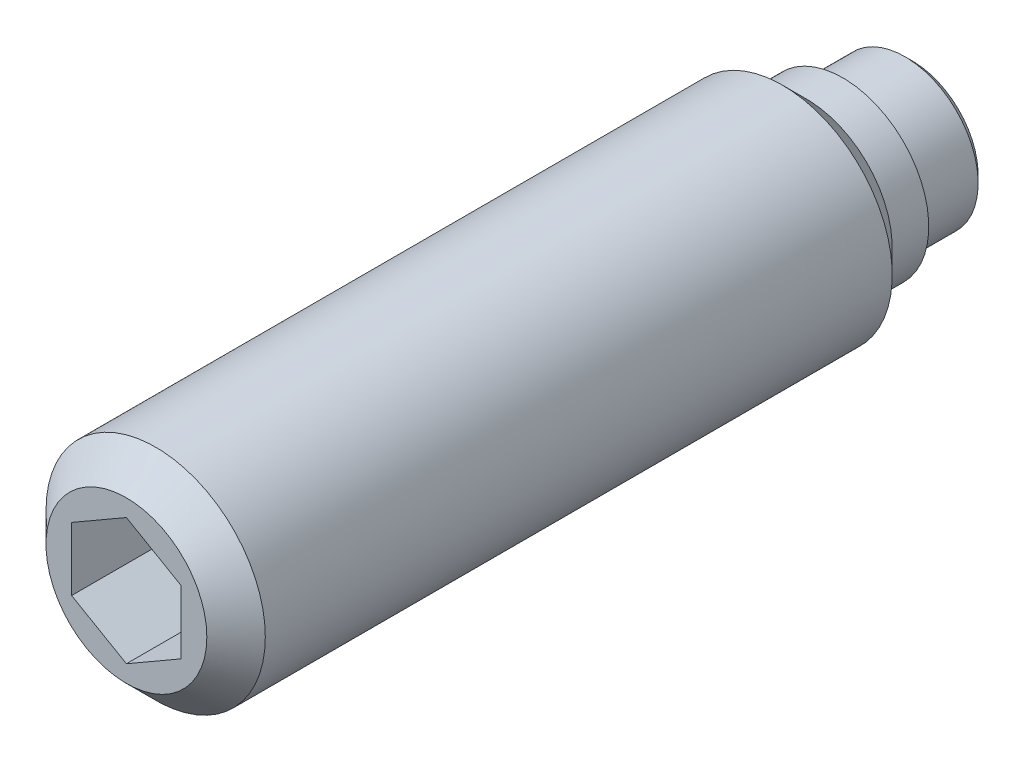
ISO-10303-21;
HEADER;
FILE_DESCRIPTION(('STEP AP214'),'2;1');
FILE_NAME('part.step','',(''),(''),'','','');
FILE_SCHEMA(('AUTOMOTIVE_DESIGN { 1 0 10303 214 1 1 1 1 }'));
ENDSEC;
DATA;
#1=APPLICATION_CONTEXT('core data for automotive mechanical design processes');
#2=APPLICATION_PROTOCOL_DEFINITION('international standard','automotive_design',2000,#1);
#3=PRODUCT_CONTEXT('',#1,'mechanical');
#4=PRODUCT('Part','Part','',(#3));
#5=PRODUCT_RELATED_PRODUCT_CATEGORY('part','',(#4));
#6=PRODUCT_DEFINITION_FORMATION('','',#4);
#7=PRODUCT_DEFINITION_CONTEXT('part definition',#1,'design');
#8=PRODUCT_DEFINITION('design','',#6,#7);
#9=PRODUCT_DEFINITION_SHAPE('','',#8);
#10=(LENGTH_UNIT() NAMED_UNIT(*) SI_UNIT(.MILLI.,.METRE.));
#11=(NAMED_UNIT(*) PLANE_ANGLE_UNIT() SI_UNIT($,.RADIAN.));
#12=(NAMED_UNIT(*) SI_UNIT($,.STERADIAN.) SOLID_ANGLE_UNIT());
#13=UNCERTAINTY_MEASURE_WITH_UNIT(LENGTH_MEASURE(1.E-05),#10,'distance_accuracy_value','');
#14=(GEOMETRIC_REPRESENTATION_CONTEXT(3) GLOBAL_UNCERTAINTY_ASSIGNED_CONTEXT((#13)) GLOBAL_UNIT_ASSIGNED_CONTEXT((#10,
#11,#12)) REPRESENTATION_CONTEXT('',''));
#15=CARTESIAN_POINT('',(0.,0.,0.));
#16=DIRECTION('',(0.,0.,1.));
#17=DIRECTION('',(1.,0.,0.));
#18=AXIS2_PLACEMENT_3D('',#15,#16,#17);
#19=CARTESIAN_POINT('',(0.,0.,1.9));
#20=DIRECTION('',(0.,0.,-1.));
#21=DIRECTION('',(-1.,0.,0.));
#22=AXIS2_PLACEMENT_3D('',#19,#20,#21);
#23=CYLINDRICAL_SURFACE('',#22,3.);
#24=CARTESIAN_POINT('',(0.,0.,20.7));
#25=DIRECTION('',(0.,0.,1.));
#26=DIRECTION('',(1.,0.,0.));
#27=AXIS2_PLACEMENT_3D('',#24,#25,#26);
#28=CIRCLE('',#27,3.);
#29=CARTESIAN_POINT('',(3.,0.,20.7));
#30=VERTEX_POINT('',#29);
#31=EDGE_CURVE('E9',#30,#30,#28,.F.);
#32=ORIENTED_EDGE('',*,*,#31,.T.);
#33=EDGE_LOOP('',(#32));
#34=FACE_BOUND('',#33,.T.);
#35=CARTESIAN_POINT('',(0.,0.,3.55));
#36=DIRECTION('',(0.,0.,-1.));
#37=DIRECTION('',(-1.,0.,0.));
#38=AXIS2_PLACEMENT_3D('',#35,#36,#37);
#39=CIRCLE('',#38,3.);
#40=CARTESIAN_POINT('',(-3.,0.,3.55));
#41=VERTEX_POINT('',#40);
#42=EDGE_CURVE('E74',#41,#41,#39,.T.);
#43=ORIENTED_EDGE('',*,*,#42,.F.);
#44=EDGE_LOOP('',(#43));
#45=FACE_BOUND('',#44,.T.);
#46=ADVANCED_FACE('F14',(#34,#45),#23,.T.);
#47=CARTESIAN_POINT('',(0.,0.,3.55));
#48=DIRECTION('',(0.,0.,1.));
#49=DIRECTION('',(1.,0.,0.));
#50=AXIS2_PLACEMENT_3D('',#47,#48,#49);
#51=CONICAL_SURFACE('',#50,3.,0.785398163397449);
#52=ORIENTED_EDGE('',*,*,#42,.T.);
#53=EDGE_LOOP('',(#52));
#54=FACE_BOUND('',#53,.T.);
#55=CARTESIAN_POINT('',(0.,0.,2.9));
#56=DIRECTION('',(0.,0.,-1.));
#57=DIRECTION('',(-1.,0.,0.));
#58=AXIS2_PLACEMENT_3D('',#55,#56,#57);
#59=CIRCLE('',#58,2.35);
#60=CARTESIAN_POINT('',(-2.35,0.,2.9));
#61=VERTEX_POINT('',#60);
#62=EDGE_CURVE('E112',#61,#61,#59,.T.);
#63=ORIENTED_EDGE('',*,*,#62,.F.);
#64=EDGE_LOOP('',(#63));
#65=FACE_BOUND('',#64,.T.);
#66=ADVANCED_FACE('F130',(#54,#65),#51,.T.);
#67=CARTESIAN_POINT('',(0.,0.,1.9));
#68=DIRECTION('',(0.,0.,-1.));
#69=DIRECTION('',(-1.,0.,0.));
#70=AXIS2_PLACEMENT_3D('',#67,#68,#69);
#71=CYLINDRICAL_SURFACE('',#70,2.35);
#72=ORIENTED_EDGE('',*,*,#62,.T.);
#73=EDGE_LOOP('',(#72));
#74=FACE_BOUND('',#73,.T.);
#75=CARTESIAN_POINT('',(0.,0.,1.9));
#76=DIRECTION('',(0.,0.,-1.));
#77=DIRECTION('',(-1.,0.,0.));
#78=AXIS2_PLACEMENT_3D('',#75,#76,#77);
#79=CIRCLE('',#78,2.35);
#80=CARTESIAN_POINT('',(-2.35,0.,1.9));
#81=VERTEX_POINT('',#80);
#82=EDGE_CURVE('E109',#81,#81,#79,.T.);
#83=ORIENTED_EDGE('',*,*,#82,.F.);
#84=EDGE_LOOP('',(#83));
#85=FACE_BOUND('',#84,.T.);
#86=ADVANCED_FACE('F135',(#74,#85),#71,.T.);
#87=CARTESIAN_POINT('',(0.,2.35,1.9));
#88=DIRECTION('',(0.,0.,1.));
#89=DIRECTION('',(1.,0.,0.));
#90=AXIS2_PLACEMENT_3D('',#87,#88,#89);
#91=PLANE('',#90);
#92=ORIENTED_EDGE('',*,*,#82,.T.);
#93=EDGE_LOOP('',(#92));
#94=FACE_BOUND('',#93,.T.);
#95=CARTESIAN_POINT('',(0.,0.,1.9));
#96=DIRECTION('',(0.,0.,-1.));
#97=DIRECTION('',(-1.,0.,0.));
#98=AXIS2_PLACEMENT_3D('',#95,#96,#97);
#99=CIRCLE('',#98,2.);
#100=CARTESIAN_POINT('',(-2.,0.,1.9));
#101=VERTEX_POINT('',#100);
#102=EDGE_CURVE('E106',#101,#101,#99,.T.);
#103=ORIENTED_EDGE('',*,*,#102,.F.);
#104=EDGE_LOOP('',(#103));
#105=FACE_BOUND('',#104,.T.);
#106=ADVANCED_FACE('F142',(#94,#105),#91,.F.);
#107=CARTESIAN_POINT('',(0.,0.,0.));
#108=DIRECTION('',(0.,0.,-1.));
#109=DIRECTION('',(-1.,0.,0.));
#110=AXIS2_PLACEMENT_3D('',#107,#108,#109);
#111=CYLINDRICAL_SURFACE('',#110,2.);
#112=CARTESIAN_POINT('',(0.,0.,0.2));
#113=DIRECTION('',(0.,0.,-1.));
#114=DIRECTION('',(-1.,0.,0.));
#115=AXIS2_PLACEMENT_3D('',#112,#113,#114);
#116=CIRCLE('',#115,2.);
#117=CARTESIAN_POINT('',(-2.,0.,0.2));
#118=VERTEX_POINT('',#117);
#119=EDGE_CURVE('E103',#118,#118,#116,.T.);
#120=ORIENTED_EDGE('',*,*,#119,.F.);
#121=EDGE_LOOP('',(#120));
#122=FACE_BOUND('',#121,.T.);
#123=ORIENTED_EDGE('',*,*,#102,.T.);
#124=EDGE_LOOP('',(#123));
#125=FACE_BOUND('',#124,.T.);
#126=ADVANCED_FACE('F146',(#122,#125),#111,.T.);
#127=CARTESIAN_POINT('',(0.,0.,0.2));
#128=DIRECTION('',(0.,0.,1.));
#129=DIRECTION('',(1.,0.,0.));
#130=AXIS2_PLACEMENT_3D('',#127,#128,#129);
#131=CONICAL_SURFACE('',#130,2.,0.785398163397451);
#132=CARTESIAN_POINT('',(0.,0.,0.));
#133=DIRECTION('',(0.,0.,-1.));
#134=DIRECTION('',(-1.,0.,0.));
#135=AXIS2_PLACEMENT_3D('',#132,#133,#134);
#136=CIRCLE('',#135,1.8);
#137=CARTESIAN_POINT('',(-1.8,0.,0.));
#138=VERTEX_POINT('',#137);
#139=EDGE_CURVE('E100',#138,#138,#136,.T.);
#140=ORIENTED_EDGE('',*,*,#139,.F.);
#141=EDGE_LOOP('',(#140));
#142=FACE_BOUND('',#141,.T.);
#143=ORIENTED_EDGE('',*,*,#119,.T.);
#144=EDGE_LOOP('',(#143));
#145=FACE_BOUND('',#144,.T.);
#146=ADVANCED_FACE('F150',(#142,#145),#131,.T.);
#147=CARTESIAN_POINT('',(0.,1.8,0.));
#148=DIRECTION('',(0.,0.,1.));
#149=DIRECTION('',(1.,0.,0.));
#150=AXIS2_PLACEMENT_3D('',#147,#148,#149);
#151=PLANE('',#150);
#152=ORIENTED_EDGE('',*,*,#139,.T.);
#153=EDGE_LOOP('',(#152));
#154=FACE_BOUND('',#153,.T.);
#155=ADVANCED_FACE('F154',(#154),#151,.F.);
#156=CARTESIAN_POINT('',(0.,0.,21.5));
#157=DIRECTION('',(0.,0.,1.));
#158=DIRECTION('',(1.,0.,0.));
#159=AXIS2_PLACEMENT_3D('',#156,#157,#158);
#160=PLANE('',#159);
#161=CARTESIAN_POINT('',(0.,0.,21.5));
#162=DIRECTION('',(0.,0.,1.));
#163=DIRECTION('',(1.,0.,0.));
#164=AXIS2_PLACEMENT_3D('',#161,#162,#163);
#165=CIRCLE('',#164,2.2);
#166=CARTESIAN_POINT('',(2.2,0.,21.5));
#167=VERTEX_POINT('',#166);
#168=EDGE_CURVE('E22',#167,#167,#165,.T.);
#169=ORIENTED_EDGE('',*,*,#168,.T.);
#170=EDGE_LOOP('',(#169));
#171=FACE_BOUND('',#170,.T.);
#172=DIRECTION('',(-0.866025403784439,0.5,0.));
#173=VECTOR('',#172,1.);
#174=CARTESIAN_POINT('',(-1.5,-0.866025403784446,21.5));
#175=LINE('',#174,#173);
#176=CARTESIAN_POINT('',(0.,-1.73205080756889,21.5));
#177=VERTEX_POINT('',#176);
#178=CARTESIAN_POINT('',(-1.5,-0.866025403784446,21.5));
#179=VERTEX_POINT('',#178);
#180=EDGE_CURVE('E69',#177,#179,#175,.T.);
#181=ORIENTED_EDGE('',*,*,#180,.T.);
#182=DIRECTION('',(0.,1.,0.));
#183=VECTOR('',#182,1.);
#184=CARTESIAN_POINT('',(-1.5,0.866025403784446,21.5));
#185=LINE('',#184,#183);
#186=CARTESIAN_POINT('',(-1.5,0.866025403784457,21.5));
#187=VERTEX_POINT('',#186);
#188=EDGE_CURVE('E84',#179,#187,#185,.T.);
#189=ORIENTED_EDGE('',*,*,#188,.T.);
#190=DIRECTION('',(0.866025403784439,0.5,0.));
#191=VECTOR('',#190,1.);
#192=CARTESIAN_POINT('',(0.,1.73205080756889,21.5));
#193=LINE('',#192,#191);
#194=CARTESIAN_POINT('',(0.,1.73205080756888,21.5));
#195=VERTEX_POINT('',#194);
#196=EDGE_CURVE('E301',#187,#195,#193,.T.);
#197=ORIENTED_EDGE('',*,*,#196,.T.);
#198=DIRECTION('',(0.866025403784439,-0.5,0.));
#199=VECTOR('',#198,1.);
#200=CARTESIAN_POINT('',(1.5,0.866025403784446,21.5));
#201=LINE('',#200,#199);
#202=CARTESIAN_POINT('',(1.5,0.866025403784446,21.5));
#203=VERTEX_POINT('',#202);
#204=EDGE_CURVE('E298',#195,#203,#201,.T.);
#205=ORIENTED_EDGE('',*,*,#204,.T.);
#206=DIRECTION('',(0.,-1.,0.));
#207=VECTOR('',#206,1.);
#208=CARTESIAN_POINT('',(1.5,-0.866025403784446,21.5));
#209=LINE('',#208,#207);
#210=CARTESIAN_POINT('',(1.5,-0.866025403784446,21.5));
#211=VERTEX_POINT('',#210);
#212=EDGE_CURVE('E29',#203,#211,#209,.T.);
#213=ORIENTED_EDGE('',*,*,#212,.T.);
#214=DIRECTION('',(-0.866025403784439,-0.5,0.));
#215=VECTOR('',#214,1.);
#216=CARTESIAN_POINT('',(0.,-1.73205080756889,21.5));
#217=LINE('',#216,#215);
#218=EDGE_CURVE('E66',#211,#177,#217,.T.);
#219=ORIENTED_EDGE('',*,*,#218,.T.);
#220=EDGE_LOOP('',(#181,#189,#197,#205,#213,#219));
#221=FACE_BOUND('',#220,.T.);
#222=ADVANCED_FACE('F68',(#171,#221),#160,.T.);
#223=CARTESIAN_POINT('',(0.,0.,18.));
#224=DIRECTION('',(0.,0.,1.));
#225=DIRECTION('',(1.,0.,0.));
#226=AXIS2_PLACEMENT_3D('',#223,#224,#225);
#227=PLANE('',#226);
#228=DIRECTION('',(0.,-1.,0.));
#229=VECTOR('',#228,1.);
#230=CARTESIAN_POINT('',(-1.5,0.866025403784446,18.));
#231=LINE('',#230,#229);
#232=CARTESIAN_POINT('',(-1.5,0.866025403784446,18.));
#233=VERTEX_POINT('',#232);
#234=CARTESIAN_POINT('',(-1.5,-0.866025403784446,18.));
#235=VERTEX_POINT('',#234);
#236=EDGE_CURVE('E83',#233,#235,#231,.T.);
#237=ORIENTED_EDGE('',*,*,#236,.T.);
#238=DIRECTION('',(0.866025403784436,-0.5,0.));
#239=VECTOR('',#238,1.);
#240=CARTESIAN_POINT('',(-1.5,-0.866025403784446,18.));
#241=LINE('',#240,#239);
#242=CARTESIAN_POINT('',(0.,-1.73205080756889,18.));
#243=VERTEX_POINT('',#242);
#244=EDGE_CURVE('E280',#235,#243,#241,.T.);
#245=ORIENTED_EDGE('',*,*,#244,.T.);
#246=DIRECTION('',(0.866025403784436,0.5,0.));
#247=VECTOR('',#246,1.);
#248=CARTESIAN_POINT('',(0.,-1.73205080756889,18.));
#249=LINE('',#248,#247);
#250=CARTESIAN_POINT('',(1.5,-0.866025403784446,18.));
#251=VERTEX_POINT('',#250);
#252=EDGE_CURVE('E88',#243,#251,#249,.T.);
#253=ORIENTED_EDGE('',*,*,#252,.T.);
#254=DIRECTION('',(0.,1.,0.));
#255=VECTOR('',#254,1.);
#256=CARTESIAN_POINT('',(1.5,-0.866025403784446,18.));
#257=LINE('',#256,#255);
#258=CARTESIAN_POINT('',(1.5,0.866025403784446,18.));
#259=VERTEX_POINT('',#258);
#260=EDGE_CURVE('E287',#251,#259,#257,.T.);
#261=ORIENTED_EDGE('',*,*,#260,.T.);
#262=DIRECTION('',(-0.866025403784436,0.5,0.));
#263=VECTOR('',#262,1.);
#264=CARTESIAN_POINT('',(1.5,0.866025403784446,18.));
#265=LINE('',#264,#263);
#266=CARTESIAN_POINT('',(0.,1.73205080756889,18.));
#267=VERTEX_POINT('',#266);
#268=EDGE_CURVE('E96',#259,#267,#265,.T.);
#269=ORIENTED_EDGE('',*,*,#268,.T.);
#270=DIRECTION('',(-0.866025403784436,-0.5,0.));
#271=VECTOR('',#270,1.);
#272=CARTESIAN_POINT('',(0.,1.73205080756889,18.));
#273=LINE('',#272,#271);
#274=EDGE_CURVE('E91',#267,#233,#273,.T.);
#275=ORIENTED_EDGE('',*,*,#274,.T.);
#276=EDGE_LOOP('',(#237,#245,#253,#261,#269,#275));
#277=FACE_BOUND('',#276,.T.);
#278=ADVANCED_FACE('F162',(#277),#227,.T.);
#279=CARTESIAN_POINT('',(0.,-1.73205080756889,23.));
#280=DIRECTION('',(0.5,-0.866025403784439,0.));
#281=DIRECTION('',(0.866025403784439,0.5,0.));
#282=AXIS2_PLACEMENT_3D('',#279,#280,#281);
#283=PLANE('',#282);
#284=ORIENTED_EDGE('',*,*,#218,.F.);
#285=DIRECTION('',(0.,0.,1.));
#286=VECTOR('',#285,1.);
#287=CARTESIAN_POINT('',(1.5,-0.866025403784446,23.));
#288=LINE('',#287,#286);
#289=EDGE_CURVE('E90',#251,#211,#288,.T.);
#290=ORIENTED_EDGE('',*,*,#289,.F.);
#291=ORIENTED_EDGE('',*,*,#252,.F.);
#292=DIRECTION('',(0.,0.,1.));
#293=VECTOR('',#292,1.);
#294=CARTESIAN_POINT('',(0.,-1.73205080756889,23.));
#295=LINE('',#294,#293);
#296=EDGE_CURVE('E80',#243,#177,#295,.T.);
#297=ORIENTED_EDGE('',*,*,#296,.T.);
#298=EDGE_LOOP('',(#284,#290,#291,#297));
#299=FACE_BOUND('',#298,.T.);
#300=ADVANCED_FACE('F86',(#299),#283,.F.);
#301=CARTESIAN_POINT('',(1.5,-0.866025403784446,23.));
#302=DIRECTION('',(1.,0.,0.));
#303=DIRECTION('',(0.,0.,-1.));
#304=AXIS2_PLACEMENT_3D('',#301,#302,#303);
#305=PLANE('',#304);
#306=ORIENTED_EDGE('',*,*,#212,.F.);
#307=DIRECTION('',(0.,0.,1.));
#308=VECTOR('',#307,1.);
#309=CARTESIAN_POINT('',(1.5,0.866025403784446,23.));
#310=LINE('',#309,#308);
#311=EDGE_CURVE('E93',#259,#203,#310,.T.);
#312=ORIENTED_EDGE('',*,*,#311,.F.);
#313=ORIENTED_EDGE('',*,*,#260,.F.);
#314=ORIENTED_EDGE('',*,*,#289,.T.);
#315=EDGE_LOOP('',(#306,#312,#313,#314));
#316=FACE_BOUND('',#315,.T.);
#317=ADVANCED_FACE('F161',(#316),#305,.F.);
#318=CARTESIAN_POINT('',(1.5,0.866025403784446,23.));
#319=DIRECTION('',(0.5,0.866025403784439,0.));
#320=DIRECTION('',(-0.866025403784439,0.5,0.));
#321=AXIS2_PLACEMENT_3D('',#318,#319,#320);
#322=PLANE('',#321);
#323=ORIENTED_EDGE('',*,*,#204,.F.);
#324=DIRECTION('',(0.,0.,1.));
#325=VECTOR('',#324,1.);
#326=CARTESIAN_POINT('',(0.,1.73205080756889,23.));
#327=LINE('',#326,#325);
#328=EDGE_CURVE('E293',#267,#195,#327,.T.);
#329=ORIENTED_EDGE('',*,*,#328,.F.);
#330=ORIENTED_EDGE('',*,*,#268,.F.);
#331=ORIENTED_EDGE('',*,*,#311,.T.);
#332=EDGE_LOOP('',(#323,#329,#330,#331));
#333=FACE_BOUND('',#332,.T.);
#334=ADVANCED_FACE('F165',(#333),#322,.F.);
#335=CARTESIAN_POINT('',(0.,1.73205080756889,23.));
#336=DIRECTION('',(-0.5,0.866025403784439,0.));
#337=DIRECTION('',(-0.866025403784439,-0.5,0.));
#338=AXIS2_PLACEMENT_3D('',#335,#336,#337);
#339=PLANE('',#338);
#340=ORIENTED_EDGE('',*,*,#196,.F.);
#341=DIRECTION('',(0.,0.,1.));
#342=VECTOR('',#341,1.);
#343=CARTESIAN_POINT('',(-1.5,0.866025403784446,23.));
#344=LINE('',#343,#342);
#345=EDGE_CURVE('E37',#233,#187,#344,.T.);
#346=ORIENTED_EDGE('',*,*,#345,.F.);
#347=ORIENTED_EDGE('',*,*,#274,.F.);
#348=ORIENTED_EDGE('',*,*,#328,.T.);
#349=EDGE_LOOP('',(#340,#346,#347,#348));
#350=FACE_BOUND('',#349,.T.);
#351=ADVANCED_FACE('F169',(#350),#339,.F.);
#352=CARTESIAN_POINT('',(-1.5,0.866025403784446,23.));
#353=DIRECTION('',(-1.,0.,0.));
#354=DIRECTION('',(0.,0.,1.));
#355=AXIS2_PLACEMENT_3D('',#352,#353,#354);
#356=PLANE('',#355);
#357=ORIENTED_EDGE('',*,*,#188,.F.);
#358=DIRECTION('',(0.,0.,1.));
#359=VECTOR('',#358,1.);
#360=CARTESIAN_POINT('',(-1.5,-0.866025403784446,23.));
#361=LINE('',#360,#359);
#362=EDGE_CURVE('E82',#235,#179,#361,.T.);
#363=ORIENTED_EDGE('',*,*,#362,.F.);
#364=ORIENTED_EDGE('',*,*,#236,.F.);
#365=ORIENTED_EDGE('',*,*,#345,.T.);
#366=EDGE_LOOP('',(#357,#363,#364,#365));
#367=FACE_BOUND('',#366,.T.);
#368=ADVANCED_FACE('F126',(#367),#356,.F.);
#369=CARTESIAN_POINT('',(-1.5,-0.866025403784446,23.));
#370=DIRECTION('',(-0.5,-0.866025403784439,0.));
#371=DIRECTION('',(0.866025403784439,-0.5,0.));
#372=AXIS2_PLACEMENT_3D('',#369,#370,#371);
#373=PLANE('',#372);
#374=ORIENTED_EDGE('',*,*,#180,.F.);
#375=ORIENTED_EDGE('',*,*,#296,.F.);
#376=ORIENTED_EDGE('',*,*,#244,.F.);
#377=ORIENTED_EDGE('',*,*,#362,.T.);
#378=EDGE_LOOP('',(#374,#375,#376,#377));
#379=FACE_BOUND('',#378,.T.);
#380=ADVANCED_FACE('F78',(#379),#373,.F.);
#381=CARTESIAN_POINT('',(0.,0.,21.5));
#382=DIRECTION('',(0.,0.,-1.));
#383=DIRECTION('',(-1.,0.,0.));
#384=AXIS2_PLACEMENT_3D('',#381,#382,#383);
#385=CONICAL_SURFACE('',#384,2.2,0.785398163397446);
#386=ORIENTED_EDGE('',*,*,#31,.F.);
#387=EDGE_LOOP('',(#386));
#388=FACE_BOUND('',#387,.T.);
#389=ORIENTED_EDGE('',*,*,#168,.F.);
#390=EDGE_LOOP('',(#389));
#391=FACE_BOUND('',#390,.T.);
#392=ADVANCED_FACE('F16',(#388,#391),#385,.T.);
#393=CLOSED_SHELL('',(#46,#66,#86,#106,#126,#146,#155,#222,#278,#300,#317,#334,#351,#368,#380,#392));
#394=MANIFOLD_SOLID_BREP('B1',#393);
#395=ADVANCED_BREP_SHAPE_REPRESENTATION('',(#18,#394),#14);
#396=SHAPE_DEFINITION_REPRESENTATION(#9,#395);
ENDSEC;
END-ISO-10303-21;
